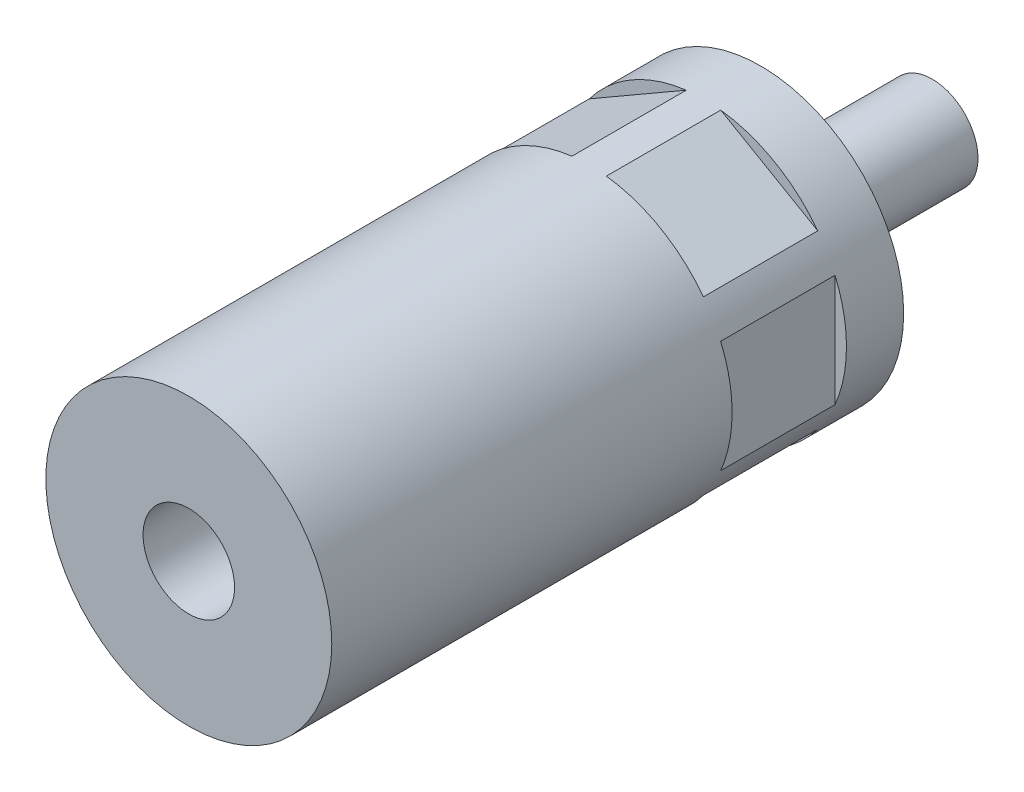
ISO-10303-21;
HEADER;
FILE_DESCRIPTION(('STEP AP214'),'2;1');
FILE_NAME('part.step','',(''),(''),'','','');
FILE_SCHEMA(('AUTOMOTIVE_DESIGN { 1 0 10303 214 1 1 1 1 }'));
ENDSEC;
DATA;
#1=APPLICATION_CONTEXT('core data for automotive mechanical design processes');
#2=APPLICATION_PROTOCOL_DEFINITION('international standard','automotive_design',2000,#1);
#3=PRODUCT_CONTEXT('',#1,'mechanical');
#4=PRODUCT('Part','Part','',(#3));
#5=PRODUCT_RELATED_PRODUCT_CATEGORY('part','',(#4));
#6=PRODUCT_DEFINITION_FORMATION('','',#4);
#7=PRODUCT_DEFINITION_CONTEXT('part definition',#1,'design');
#8=PRODUCT_DEFINITION('design','',#6,#7);
#9=PRODUCT_DEFINITION_SHAPE('','',#8);
#10=(LENGTH_UNIT() NAMED_UNIT(*) SI_UNIT(.MILLI.,.METRE.));
#11=(NAMED_UNIT(*) PLANE_ANGLE_UNIT() SI_UNIT($,.RADIAN.));
#12=(NAMED_UNIT(*) SI_UNIT($,.STERADIAN.) SOLID_ANGLE_UNIT());
#13=UNCERTAINTY_MEASURE_WITH_UNIT(LENGTH_MEASURE(1.E-05),#10,'distance_accuracy_value','');
#14=(GEOMETRIC_REPRESENTATION_CONTEXT(3) GLOBAL_UNCERTAINTY_ASSIGNED_CONTEXT((#13)) GLOBAL_UNIT_ASSIGNED_CONTEXT((#10,
#11,#12)) REPRESENTATION_CONTEXT('',''));
#15=CARTESIAN_POINT('',(0.,0.,0.));
#16=DIRECTION('',(0.,0.,1.));
#17=DIRECTION('',(1.,0.,0.));
#18=AXIS2_PLACEMENT_3D('',#15,#16,#17);
#19=CARTESIAN_POINT('',(0.,0.,80.));
#20=DIRECTION('',(0.,0.,1.));
#21=DIRECTION('',(1.,0.,0.));
#22=AXIS2_PLACEMENT_3D('',#19,#20,#21);
#23=CYLINDRICAL_SURFACE('',#22,25.);
#24=CARTESIAN_POINT('',(0.,0.,10.));
#25=DIRECTION('',(0.,0.,1.));
#26=DIRECTION('',(1.,0.,0.));
#27=AXIS2_PLACEMENT_3D('',#24,#25,#26);
#28=CIRCLE('',#27,25.);
#29=CARTESIAN_POINT('',(-19.9852813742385,-15.0196048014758,10.));
#30=VERTEX_POINT('',#29);
#31=CARTESIAN_POINT('',(-3.0147186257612,-24.8175637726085,10.));
#32=VERTEX_POINT('',#31);
#33=EDGE_CURVE('E152',#30,#32,#28,.T.);
#34=ORIENTED_EDGE('',*,*,#33,.F.);
#35=DIRECTION('',(0.,0.,1.));
#36=VECTOR('',#35,1.);
#37=CARTESIAN_POINT('',(-19.9852813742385,-15.0196048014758,80.));
#38=LINE('',#37,#36);
#39=CARTESIAN_POINT('',(-19.9852813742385,-15.0196048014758,30.));
#40=VERTEX_POINT('',#39);
#41=EDGE_CURVE('E9',#30,#40,#38,.T.);
#42=ORIENTED_EDGE('',*,*,#41,.T.);
#43=CARTESIAN_POINT('',(0.,0.,30.));
#44=DIRECTION('',(0.,0.,1.));
#45=DIRECTION('',(1.,0.,0.));
#46=AXIS2_PLACEMENT_3D('',#43,#44,#45);
#47=CIRCLE('',#46,25.);
#48=CARTESIAN_POINT('',(-3.0147186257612,-24.8175637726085,30.));
#49=VERTEX_POINT('',#48);
#50=EDGE_CURVE('E22',#40,#49,#47,.T.);
#51=ORIENTED_EDGE('',*,*,#50,.T.);
#52=DIRECTION('',(0.,0.,1.));
#53=VECTOR('',#52,1.);
#54=CARTESIAN_POINT('',(-3.0147186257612,-24.8175637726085,80.));
#55=LINE('',#54,#53);
#56=EDGE_CURVE('E149',#49,#32,#55,.F.);
#57=ORIENTED_EDGE('',*,*,#56,.T.);
#58=EDGE_LOOP('',(#34,#42,#51,#57));
#59=FACE_BOUND('',#58,.T.);
#60=DIRECTION('',(0.,0.,1.));
#61=VECTOR('',#60,1.);
#62=CARTESIAN_POINT('',(23.,9.79795897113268,80.));
#63=LINE('',#62,#61);
#64=CARTESIAN_POINT('',(23.,9.79795897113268,10.));
#65=VERTEX_POINT('',#64);
#66=CARTESIAN_POINT('',(23.,9.79795897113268,30.));
#67=VERTEX_POINT('',#66);
#68=EDGE_CURVE('E142',#65,#67,#63,.T.);
#69=ORIENTED_EDGE('',*,*,#68,.F.);
#70=CARTESIAN_POINT('',(23.,-9.7979589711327,10.));
#71=VERTEX_POINT('',#70);
#72=EDGE_CURVE('E141',#71,#65,#28,.T.);
#73=ORIENTED_EDGE('',*,*,#72,.F.);
#74=DIRECTION('',(0.,0.,1.));
#75=VECTOR('',#74,1.);
#76=CARTESIAN_POINT('',(23.,-9.7979589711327,80.));
#77=LINE('',#76,#75);
#78=CARTESIAN_POINT('',(23.,-9.7979589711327,30.));
#79=VERTEX_POINT('',#78);
#80=EDGE_CURVE('E138',#79,#71,#77,.F.);
#81=ORIENTED_EDGE('',*,*,#80,.F.);
#82=EDGE_CURVE('E145',#79,#67,#47,.T.);
#83=ORIENTED_EDGE('',*,*,#82,.T.);
#84=EDGE_LOOP('',(#69,#73,#81,#83));
#85=FACE_BOUND('',#84,.T.);
#86=CARTESIAN_POINT('',(19.9852813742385,15.0196048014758,10.));
#87=VERTEX_POINT('',#86);
#88=CARTESIAN_POINT('',(3.0147186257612,24.8175637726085,10.));
#89=VERTEX_POINT('',#88);
#90=EDGE_CURVE('E134',#87,#89,#28,.T.);
#91=ORIENTED_EDGE('',*,*,#90,.F.);
#92=DIRECTION('',(0.,0.,1.));
#93=VECTOR('',#92,1.);
#94=CARTESIAN_POINT('',(19.9852813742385,15.0196048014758,80.));
#95=LINE('',#94,#93);
#96=CARTESIAN_POINT('',(19.9852813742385,15.0196048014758,30.));
#97=VERTEX_POINT('',#96);
#98=EDGE_CURVE('E135',#87,#97,#95,.T.);
#99=ORIENTED_EDGE('',*,*,#98,.T.);
#100=CARTESIAN_POINT('',(3.0147186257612,24.8175637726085,30.));
#101=VERTEX_POINT('',#100);
#102=EDGE_CURVE('E139',#97,#101,#47,.T.);
#103=ORIENTED_EDGE('',*,*,#102,.T.);
#104=DIRECTION('',(0.,0.,1.));
#105=VECTOR('',#104,1.);
#106=CARTESIAN_POINT('',(3.0147186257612,24.8175637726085,80.));
#107=LINE('',#106,#105);
#108=EDGE_CURVE('E131',#101,#89,#107,.F.);
#109=ORIENTED_EDGE('',*,*,#108,.T.);
#110=EDGE_LOOP('',(#91,#99,#103,#109));
#111=FACE_BOUND('',#110,.T.);
#112=CARTESIAN_POINT('',(0.,0.,0.));
#113=DIRECTION('',(0.,0.,1.));
#114=DIRECTION('',(1.,0.,0.));
#115=AXIS2_PLACEMENT_3D('',#112,#113,#114);
#116=CIRCLE('',#115,25.);
#117=CARTESIAN_POINT('',(25.,0.,0.));
#118=VERTEX_POINT('',#117);
#119=EDGE_CURVE('E210',#118,#118,#116,.T.);
#120=ORIENTED_EDGE('',*,*,#119,.T.);
#121=EDGE_LOOP('',(#120));
#122=FACE_BOUND('',#121,.T.);
#123=CARTESIAN_POINT('',(0.,0.,100.));
#124=DIRECTION('',(0.,0.,1.));
#125=DIRECTION('',(1.,0.,0.));
#126=AXIS2_PLACEMENT_3D('',#123,#124,#125);
#127=CIRCLE('',#126,25.);
#128=CARTESIAN_POINT('',(25.,0.,100.));
#129=VERTEX_POINT('',#128);
#130=EDGE_CURVE('E213',#129,#129,#127,.T.);
#131=ORIENTED_EDGE('',*,*,#130,.F.);
#132=EDGE_LOOP('',(#131));
#133=FACE_BOUND('',#132,.T.);
#134=CARTESIAN_POINT('',(-23.,9.79795897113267,10.));
#135=VERTEX_POINT('',#134);
#136=CARTESIAN_POINT('',(-23.,-9.79795897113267,10.));
#137=VERTEX_POINT('',#136);
#138=EDGE_CURVE('E111',#135,#137,#28,.T.);
#139=ORIENTED_EDGE('',*,*,#138,.F.);
#140=DIRECTION('',(0.,0.,1.));
#141=VECTOR('',#140,1.);
#142=CARTESIAN_POINT('',(-23.,9.79795897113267,80.));
#143=LINE('',#142,#141);
#144=CARTESIAN_POINT('',(-23.,9.79795897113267,30.));
#145=VERTEX_POINT('',#144);
#146=EDGE_CURVE('E110',#135,#145,#143,.T.);
#147=ORIENTED_EDGE('',*,*,#146,.T.);
#148=CARTESIAN_POINT('',(-23.,-9.79795897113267,30.));
#149=VERTEX_POINT('',#148);
#150=EDGE_CURVE('E103',#145,#149,#47,.T.);
#151=ORIENTED_EDGE('',*,*,#150,.T.);
#152=DIRECTION('',(0.,0.,1.));
#153=VECTOR('',#152,1.);
#154=CARTESIAN_POINT('',(-23.,-9.79795897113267,80.));
#155=LINE('',#154,#153);
#156=EDGE_CURVE('E117',#149,#137,#155,.F.);
#157=ORIENTED_EDGE('',*,*,#156,.T.);
#158=EDGE_LOOP('',(#139,#147,#151,#157));
#159=FACE_BOUND('',#158,.T.);
#160=DIRECTION('',(0.,0.,1.));
#161=VECTOR('',#160,1.);
#162=CARTESIAN_POINT('',(-19.9852813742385,15.0196048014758,80.));
#163=LINE('',#162,#161);
#164=CARTESIAN_POINT('',(-19.9852813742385,15.0196048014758,10.));
#165=VERTEX_POINT('',#164);
#166=CARTESIAN_POINT('',(-19.9852813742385,15.0196048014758,30.));
#167=VERTEX_POINT('',#166);
#168=EDGE_CURVE('E129',#165,#167,#163,.T.);
#169=ORIENTED_EDGE('',*,*,#168,.F.);
#170=CARTESIAN_POINT('',(-3.0147186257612,24.8175637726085,10.));
#171=VERTEX_POINT('',#170);
#172=EDGE_CURVE('E125',#171,#165,#28,.T.);
#173=ORIENTED_EDGE('',*,*,#172,.F.);
#174=DIRECTION('',(0.,0.,1.));
#175=VECTOR('',#174,1.);
#176=CARTESIAN_POINT('',(-3.01471862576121,24.8175637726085,80.));
#177=LINE('',#176,#175);
#178=CARTESIAN_POINT('',(-3.01471862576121,24.8175637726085,30.));
#179=VERTEX_POINT('',#178);
#180=EDGE_CURVE('E123',#179,#171,#177,.F.);
#181=ORIENTED_EDGE('',*,*,#180,.F.);
#182=EDGE_CURVE('E113',#179,#167,#47,.T.);
#183=ORIENTED_EDGE('',*,*,#182,.T.);
#184=EDGE_LOOP('',(#169,#173,#181,#183));
#185=FACE_BOUND('',#184,.T.);
#186=DIRECTION('',(0.,0.,1.));
#187=VECTOR('',#186,1.);
#188=CARTESIAN_POINT('',(19.9852813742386,-15.0196048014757,80.));
#189=LINE('',#188,#187);
#190=CARTESIAN_POINT('',(19.9852813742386,-15.0196048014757,10.));
#191=VERTEX_POINT('',#190);
#192=CARTESIAN_POINT('',(19.9852813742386,-15.0196048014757,30.));
#193=VERTEX_POINT('',#192);
#194=EDGE_CURVE('E148',#191,#193,#189,.T.);
#195=ORIENTED_EDGE('',*,*,#194,.F.);
#196=CARTESIAN_POINT('',(3.0147186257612,-24.8175637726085,10.));
#197=VERTEX_POINT('',#196);
#198=EDGE_CURVE('E147',#197,#191,#28,.T.);
#199=ORIENTED_EDGE('',*,*,#198,.F.);
#200=DIRECTION('',(0.,0.,1.));
#201=VECTOR('',#200,1.);
#202=CARTESIAN_POINT('',(3.0147186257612,-24.8175637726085,80.));
#203=LINE('',#202,#201);
#204=CARTESIAN_POINT('',(3.0147186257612,-24.8175637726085,30.));
#205=VERTEX_POINT('',#204);
#206=EDGE_CURVE('E144',#205,#197,#203,.F.);
#207=ORIENTED_EDGE('',*,*,#206,.F.);
#208=EDGE_CURVE('E150',#205,#193,#47,.T.);
#209=ORIENTED_EDGE('',*,*,#208,.T.);
#210=EDGE_LOOP('',(#195,#199,#207,#209));
#211=FACE_BOUND('',#210,.T.);
#212=ADVANCED_FACE('F14',(#59,#85,#111,#122,#133,#159,#185,#211),#23,.T.);
#213=CARTESIAN_POINT('',(0.,0.,-30.));
#214=DIRECTION('',(0.,0.,1.));
#215=DIRECTION('',(1.,0.,0.));
#216=AXIS2_PLACEMENT_3D('',#213,#214,#215);
#217=PLANE('',#216);
#218=CARTESIAN_POINT('',(0.,0.,-30.));
#219=DIRECTION('',(0.,0.,1.));
#220=DIRECTION('',(1.,0.,0.));
#221=AXIS2_PLACEMENT_3D('',#218,#219,#220);
#222=CIRCLE('',#221,8.);
#223=CARTESIAN_POINT('',(8.,0.,-30.));
#224=VERTEX_POINT('',#223);
#225=EDGE_CURVE('E190',#224,#224,#222,.T.);
#226=ORIENTED_EDGE('',*,*,#225,.F.);
#227=EDGE_LOOP('',(#226));
#228=FACE_BOUND('',#227,.T.);
#229=ADVANCED_FACE('F16',(#228),#217,.F.);
#230=CARTESIAN_POINT('',(0.,0.,80.));
#231=DIRECTION('',(0.,0.,1.));
#232=DIRECTION('',(1.,0.,0.));
#233=AXIS2_PLACEMENT_3D('',#230,#231,#232);
#234=CYLINDRICAL_SURFACE('',#233,8.);
#235=CARTESIAN_POINT('',(0.,0.,65.));
#236=DIRECTION('',(0.,0.,1.));
#237=DIRECTION('',(1.,0.,0.));
#238=AXIS2_PLACEMENT_3D('',#235,#236,#237);
#239=CIRCLE('',#238,8.);
#240=CARTESIAN_POINT('',(8.,0.,65.));
#241=VERTEX_POINT('',#240);
#242=EDGE_CURVE('E245',#241,#241,#239,.T.);
#243=ORIENTED_EDGE('',*,*,#242,.F.);
#244=EDGE_LOOP('',(#243));
#245=FACE_BOUND('',#244,.T.);
#246=CARTESIAN_POINT('',(0.,0.,100.));
#247=DIRECTION('',(0.,0.,1.));
#248=DIRECTION('',(1.,0.,0.));
#249=AXIS2_PLACEMENT_3D('',#246,#247,#248);
#250=CIRCLE('',#249,8.);
#251=CARTESIAN_POINT('',(8.,0.,100.));
#252=VERTEX_POINT('',#251);
#253=EDGE_CURVE('E159',#252,#252,#250,.T.);
#254=ORIENTED_EDGE('',*,*,#253,.T.);
#255=EDGE_LOOP('',(#254));
#256=FACE_BOUND('',#255,.T.);
#257=ADVANCED_FACE('F219',(#245,#256),#234,.F.);
#258=CARTESIAN_POINT('',(25.,0.,100.));
#259=DIRECTION('',(0.,0.,-1.));
#260=DIRECTION('',(-1.,0.,0.));
#261=AXIS2_PLACEMENT_3D('',#258,#259,#260);
#262=PLANE('',#261);
#263=ORIENTED_EDGE('',*,*,#253,.F.);
#264=EDGE_LOOP('',(#263));
#265=FACE_BOUND('',#264,.T.);
#266=ORIENTED_EDGE('',*,*,#130,.T.);
#267=EDGE_LOOP('',(#266));
#268=FACE_BOUND('',#267,.T.);
#269=ADVANCED_FACE('F221',(#265,#268),#262,.F.);
#270=CARTESIAN_POINT('',(25.,0.,0.));
#271=DIRECTION('',(0.,0.,-1.));
#272=DIRECTION('',(-1.,0.,0.));
#273=AXIS2_PLACEMENT_3D('',#270,#271,#272);
#274=PLANE('',#273);
#275=CARTESIAN_POINT('',(0.,0.,0.));
#276=DIRECTION('',(0.,0.,1.));
#277=DIRECTION('',(1.,0.,0.));
#278=AXIS2_PLACEMENT_3D('',#275,#276,#277);
#279=CIRCLE('',#278,6.5);
#280=CARTESIAN_POINT('',(6.5,0.,0.));
#281=VERTEX_POINT('',#280);
#282=EDGE_CURVE('E207',#281,#281,#279,.T.);
#283=ORIENTED_EDGE('',*,*,#282,.T.);
#284=EDGE_LOOP('',(#283));
#285=FACE_BOUND('',#284,.T.);
#286=ORIENTED_EDGE('',*,*,#119,.F.);
#287=EDGE_LOOP('',(#286));
#288=FACE_BOUND('',#287,.T.);
#289=ADVANCED_FACE('F224',(#285,#288),#274,.T.);
#290=CARTESIAN_POINT('',(0.,0.,80.));
#291=DIRECTION('',(0.,0.,1.));
#292=DIRECTION('',(1.,0.,0.));
#293=AXIS2_PLACEMENT_3D('',#290,#291,#292);
#294=CYLINDRICAL_SURFACE('',#293,6.5);
#295=CARTESIAN_POINT('',(0.,0.,-4.));
#296=DIRECTION('',(0.,0.,1.));
#297=DIRECTION('',(1.,0.,0.));
#298=AXIS2_PLACEMENT_3D('',#295,#296,#297);
#299=CIRCLE('',#298,6.5);
#300=CARTESIAN_POINT('',(6.5,0.,-4.));
#301=VERTEX_POINT('',#300);
#302=EDGE_CURVE('E204',#301,#301,#299,.T.);
#303=ORIENTED_EDGE('',*,*,#302,.T.);
#304=EDGE_LOOP('',(#303));
#305=FACE_BOUND('',#304,.T.);
#306=ORIENTED_EDGE('',*,*,#282,.F.);
#307=EDGE_LOOP('',(#306));
#308=FACE_BOUND('',#307,.T.);
#309=ADVANCED_FACE('F443',(#305,#308),#294,.T.);
#310=CARTESIAN_POINT('',(6.5,0.,-4.));
#311=DIRECTION('',(0.,0.,1.));
#312=DIRECTION('',(1.,0.,0.));
#313=AXIS2_PLACEMENT_3D('',#310,#311,#312);
#314=PLANE('',#313);
#315=CARTESIAN_POINT('',(0.,0.,-4.));
#316=DIRECTION('',(0.,0.,1.));
#317=DIRECTION('',(1.,0.,0.));
#318=AXIS2_PLACEMENT_3D('',#315,#316,#317);
#319=CIRCLE('',#318,8.);
#320=CARTESIAN_POINT('',(8.,0.,-4.));
#321=VERTEX_POINT('',#320);
#322=EDGE_CURVE('E201',#321,#321,#319,.T.);
#323=ORIENTED_EDGE('',*,*,#322,.T.);
#324=EDGE_LOOP('',(#323));
#325=FACE_BOUND('',#324,.T.);
#326=ORIENTED_EDGE('',*,*,#302,.F.);
#327=EDGE_LOOP('',(#326));
#328=FACE_BOUND('',#327,.T.);
#329=ADVANCED_FACE('F339',(#325,#328),#314,.T.);
#330=CARTESIAN_POINT('',(0.,0.,80.));
#331=DIRECTION('',(0.,0.,1.));
#332=DIRECTION('',(1.,0.,0.));
#333=AXIS2_PLACEMENT_3D('',#330,#331,#332);
#334=CYLINDRICAL_SURFACE('',#333,8.);
#335=ORIENTED_EDGE('',*,*,#322,.F.);
#336=EDGE_LOOP('',(#335));
#337=FACE_BOUND('',#336,.T.);
#338=ORIENTED_EDGE('',*,*,#225,.T.);
#339=EDGE_LOOP('',(#338));
#340=FACE_BOUND('',#339,.T.);
#341=ADVANCED_FACE('F333',(#337,#340),#334,.T.);
#342=CARTESIAN_POINT('',(-23.,13.2790561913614,30.));
#343=DIRECTION('',(1.,0.,0.));
#344=DIRECTION('',(0.,1.,0.));
#345=AXIS2_PLACEMENT_3D('',#342,#343,#344);
#346=PLANE('',#345);
#347=DIRECTION('',(0.,-1.,0.));
#348=VECTOR('',#347,1.);
#349=CARTESIAN_POINT('',(-23.,13.2790561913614,10.));
#350=LINE('',#349,#348);
#351=EDGE_CURVE('E247',#135,#137,#350,.T.);
#352=ORIENTED_EDGE('',*,*,#351,.T.);
#353=ORIENTED_EDGE('',*,*,#156,.F.);
#354=DIRECTION('',(0.,-1.,0.));
#355=VECTOR('',#354,1.);
#356=CARTESIAN_POINT('',(-23.,13.2790561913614,30.));
#357=LINE('',#356,#355);
#358=EDGE_CURVE('E106',#145,#149,#357,.T.);
#359=ORIENTED_EDGE('',*,*,#358,.F.);
#360=ORIENTED_EDGE('',*,*,#146,.F.);
#361=EDGE_LOOP('',(#352,#353,#359,#360));
#362=FACE_BOUND('',#361,.T.);
#363=ADVANCED_FACE('F115',(#362),#346,.F.);
#364=CARTESIAN_POINT('',(0.,0.,10.));
#365=DIRECTION('',(0.,0.,1.));
#366=DIRECTION('',(1.,0.,0.));
#367=AXIS2_PLACEMENT_3D('',#364,#365,#366);
#368=PLANE('',#367);
#369=ORIENTED_EDGE('',*,*,#138,.T.);
#370=ORIENTED_EDGE('',*,*,#351,.F.);
#371=EDGE_LOOP('',(#369,#370));
#372=FACE_BOUND('',#371,.T.);
#373=ADVANCED_FACE('F281',(#372),#368,.T.);
#374=CARTESIAN_POINT('',(0.,0.,30.));
#375=DIRECTION('',(0.,0.,1.));
#376=DIRECTION('',(1.,0.,0.));
#377=AXIS2_PLACEMENT_3D('',#374,#375,#376);
#378=PLANE('',#377);
#379=ORIENTED_EDGE('',*,*,#358,.T.);
#380=ORIENTED_EDGE('',*,*,#150,.F.);
#381=EDGE_LOOP('',(#379,#380));
#382=FACE_BOUND('',#381,.T.);
#383=ADVANCED_FACE('F105',(#382),#378,.F.);
#384=CARTESIAN_POINT('',(-23.,13.2790561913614,30.));
#385=DIRECTION('',(-0.5,0.866025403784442,0.));
#386=DIRECTION('',(-0.866025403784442,-0.5,0.));
#387=AXIS2_PLACEMENT_3D('',#384,#385,#386);
#388=PLANE('',#387);
#389=ORIENTED_EDGE('',*,*,#168,.T.);
#390=DIRECTION('',(0.866025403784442,0.5,0.));
#391=VECTOR('',#390,1.);
#392=CARTESIAN_POINT('',(-23.,13.2790561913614,30.));
#393=LINE('',#392,#391);
#394=EDGE_CURVE('E118',#167,#179,#393,.T.);
#395=ORIENTED_EDGE('',*,*,#394,.T.);
#396=ORIENTED_EDGE('',*,*,#180,.T.);
#397=DIRECTION('',(0.866025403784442,0.5,0.));
#398=VECTOR('',#397,1.);
#399=CARTESIAN_POINT('',(-23.,13.2790561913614,10.));
#400=LINE('',#399,#398);
#401=EDGE_CURVE('E249',#165,#171,#400,.T.);
#402=ORIENTED_EDGE('',*,*,#401,.F.);
#403=EDGE_LOOP('',(#389,#395,#396,#402));
#404=FACE_BOUND('',#403,.T.);
#405=ADVANCED_FACE('F265',(#404),#388,.T.);
#406=ORIENTED_EDGE('',*,*,#172,.T.);
#407=ORIENTED_EDGE('',*,*,#401,.T.);
#408=EDGE_LOOP('',(#406,#407));
#409=FACE_BOUND('',#408,.T.);
#410=ADVANCED_FACE('F259',(#409),#368,.T.);
#411=ORIENTED_EDGE('',*,*,#394,.F.);
#412=ORIENTED_EDGE('',*,*,#182,.F.);
#413=EDGE_LOOP('',(#411,#412));
#414=FACE_BOUND('',#413,.T.);
#415=ADVANCED_FACE('F267',(#414),#378,.F.);
#416=CARTESIAN_POINT('',(23.,13.2790561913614,30.));
#417=DIRECTION('',(-0.499999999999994,-0.866025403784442,0.));
#418=DIRECTION('',(0.866025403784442,-0.499999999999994,0.));
#419=AXIS2_PLACEMENT_3D('',#416,#417,#418);
#420=PLANE('',#419);
#421=DIRECTION('',(-0.866025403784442,0.499999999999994,0.));
#422=VECTOR('',#421,1.);
#423=CARTESIAN_POINT('',(23.,13.2790561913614,10.));
#424=LINE('',#423,#422);
#425=EDGE_CURVE('E257',#87,#89,#424,.T.);
#426=ORIENTED_EDGE('',*,*,#425,.T.);
#427=ORIENTED_EDGE('',*,*,#108,.F.);
#428=DIRECTION('',(-0.866025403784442,0.499999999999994,0.));
#429=VECTOR('',#428,1.);
#430=CARTESIAN_POINT('',(23.,13.2790561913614,30.));
#431=LINE('',#430,#429);
#432=EDGE_CURVE('E192',#97,#101,#431,.T.);
#433=ORIENTED_EDGE('',*,*,#432,.F.);
#434=ORIENTED_EDGE('',*,*,#98,.F.);
#435=EDGE_LOOP('',(#426,#427,#433,#434));
#436=FACE_BOUND('',#435,.T.);
#437=ADVANCED_FACE('F269',(#436),#420,.F.);
#438=ORIENTED_EDGE('',*,*,#90,.T.);
#439=ORIENTED_EDGE('',*,*,#425,.F.);
#440=EDGE_LOOP('',(#438,#439));
#441=FACE_BOUND('',#440,.T.);
#442=ADVANCED_FACE('F277',(#441),#368,.T.);
#443=ORIENTED_EDGE('',*,*,#432,.T.);
#444=ORIENTED_EDGE('',*,*,#102,.F.);
#445=EDGE_LOOP('',(#443,#444));
#446=FACE_BOUND('',#445,.T.);
#447=ADVANCED_FACE('F271',(#446),#378,.F.);
#448=CARTESIAN_POINT('',(23.,13.2790561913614,30.));
#449=DIRECTION('',(1.,0.,0.));
#450=DIRECTION('',(0.,1.,0.));
#451=AXIS2_PLACEMENT_3D('',#448,#449,#450);
#452=PLANE('',#451);
#453=ORIENTED_EDGE('',*,*,#68,.T.);
#454=DIRECTION('',(0.,-1.,0.));
#455=VECTOR('',#454,1.);
#456=CARTESIAN_POINT('',(23.,13.2790561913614,30.));
#457=LINE('',#456,#455);
#458=EDGE_CURVE('E187',#67,#79,#457,.T.);
#459=ORIENTED_EDGE('',*,*,#458,.T.);
#460=ORIENTED_EDGE('',*,*,#80,.T.);
#461=DIRECTION('',(0.,-1.,0.));
#462=VECTOR('',#461,1.);
#463=CARTESIAN_POINT('',(23.,13.2790561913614,10.));
#464=LINE('',#463,#462);
#465=EDGE_CURVE('E256',#65,#71,#464,.T.);
#466=ORIENTED_EDGE('',*,*,#465,.F.);
#467=EDGE_LOOP('',(#453,#459,#460,#466));
#468=FACE_BOUND('',#467,.T.);
#469=ADVANCED_FACE('F286',(#468),#452,.T.);
#470=ORIENTED_EDGE('',*,*,#72,.T.);
#471=ORIENTED_EDGE('',*,*,#465,.T.);
#472=EDGE_LOOP('',(#470,#471));
#473=FACE_BOUND('',#472,.T.);
#474=ADVANCED_FACE('F294',(#473),#368,.T.);
#475=ORIENTED_EDGE('',*,*,#458,.F.);
#476=ORIENTED_EDGE('',*,*,#82,.F.);
#477=EDGE_LOOP('',(#475,#476));
#478=FACE_BOUND('',#477,.T.);
#479=ADVANCED_FACE('F288',(#478),#378,.F.);
#480=CARTESIAN_POINT('',(23.,-13.2790561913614,30.));
#481=DIRECTION('',(0.5,-0.866025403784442,0.));
#482=DIRECTION('',(0.866025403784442,0.5,0.));
#483=AXIS2_PLACEMENT_3D('',#480,#481,#482);
#484=PLANE('',#483);
#485=ORIENTED_EDGE('',*,*,#194,.T.);
#486=DIRECTION('',(-0.866025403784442,-0.5,0.));
#487=VECTOR('',#486,1.);
#488=CARTESIAN_POINT('',(23.,-13.2790561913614,30.));
#489=LINE('',#488,#487);
#490=EDGE_CURVE('E37',#193,#205,#489,.T.);
#491=ORIENTED_EDGE('',*,*,#490,.T.);
#492=ORIENTED_EDGE('',*,*,#206,.T.);
#493=DIRECTION('',(-0.866025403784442,-0.5,0.));
#494=VECTOR('',#493,1.);
#495=CARTESIAN_POINT('',(23.,-13.2790561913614,10.));
#496=LINE('',#495,#494);
#497=EDGE_CURVE('E253',#191,#197,#496,.T.);
#498=ORIENTED_EDGE('',*,*,#497,.F.);
#499=EDGE_LOOP('',(#485,#491,#492,#498));
#500=FACE_BOUND('',#499,.T.);
#501=ADVANCED_FACE('F298',(#500),#484,.T.);
#502=ORIENTED_EDGE('',*,*,#198,.T.);
#503=ORIENTED_EDGE('',*,*,#497,.T.);
#504=EDGE_LOOP('',(#502,#503));
#505=FACE_BOUND('',#504,.T.);
#506=ADVANCED_FACE('F305',(#505),#368,.T.);
#507=ORIENTED_EDGE('',*,*,#490,.F.);
#508=ORIENTED_EDGE('',*,*,#208,.F.);
#509=EDGE_LOOP('',(#507,#508));
#510=FACE_BOUND('',#509,.T.);
#511=ADVANCED_FACE('F185',(#510),#378,.F.);
#512=DIRECTION('',(0.866025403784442,-0.5,0.));
#513=VECTOR('',#512,1.);
#514=CARTESIAN_POINT('',(-23.,-13.2790561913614,30.));
#515=LINE('',#514,#513);
#516=EDGE_CURVE('E186',#40,#49,#515,.T.);
#517=ORIENTED_EDGE('',*,*,#516,.T.);
#518=ORIENTED_EDGE('',*,*,#50,.F.);
#519=EDGE_LOOP('',(#517,#518));
#520=FACE_BOUND('',#519,.T.);
#521=ADVANCED_FACE('F284',(#520),#378,.F.);
#522=ORIENTED_EDGE('',*,*,#33,.T.);
#523=DIRECTION('',(0.866025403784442,-0.5,0.));
#524=VECTOR('',#523,1.);
#525=CARTESIAN_POINT('',(-23.,-13.2790561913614,10.));
#526=LINE('',#525,#524);
#527=EDGE_CURVE('E29',#30,#32,#526,.T.);
#528=ORIENTED_EDGE('',*,*,#527,.F.);
#529=EDGE_LOOP('',(#522,#528));
#530=FACE_BOUND('',#529,.T.);
#531=ADVANCED_FACE('F314',(#530),#368,.T.);
#532=CARTESIAN_POINT('',(-23.,-13.2790561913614,30.));
#533=DIRECTION('',(0.5,0.866025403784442,0.));
#534=DIRECTION('',(-0.866025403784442,0.5,0.));
#535=AXIS2_PLACEMENT_3D('',#532,#533,#534);
#536=PLANE('',#535);
#537=ORIENTED_EDGE('',*,*,#527,.T.);
#538=ORIENTED_EDGE('',*,*,#56,.F.);
#539=ORIENTED_EDGE('',*,*,#516,.F.);
#540=ORIENTED_EDGE('',*,*,#41,.F.);
#541=EDGE_LOOP('',(#537,#538,#539,#540));
#542=FACE_BOUND('',#541,.T.);
#543=ADVANCED_FACE('F321',(#542),#536,.F.);
#544=CARTESIAN_POINT('',(0.,0.,65.));
#545=DIRECTION('',(0.,0.,1.));
#546=DIRECTION('',(1.,0.,0.));
#547=AXIS2_PLACEMENT_3D('',#544,#545,#546);
#548=PLANE('',#547);
#549=ORIENTED_EDGE('',*,*,#242,.T.);
#550=EDGE_LOOP('',(#549));
#551=FACE_BOUND('',#550,.T.);
#552=ADVANCED_FACE('F326',(#551),#548,.T.);
#553=CLOSED_SHELL('',(#212,#229,#257,#269,#289,#309,#329,#341,#363,#373,#383,#405,#410,#415,
#437,#442,#447,#469,#474,#479,#501,#506,#511,#521,#531,#543,#552));
#554=MANIFOLD_SOLID_BREP('B1',#553);
#555=ADVANCED_BREP_SHAPE_REPRESENTATION('',(#18,#554),#14);
#556=SHAPE_DEFINITION_REPRESENTATION(#9,#555);
ENDSEC;
END-ISO-10303-21;
